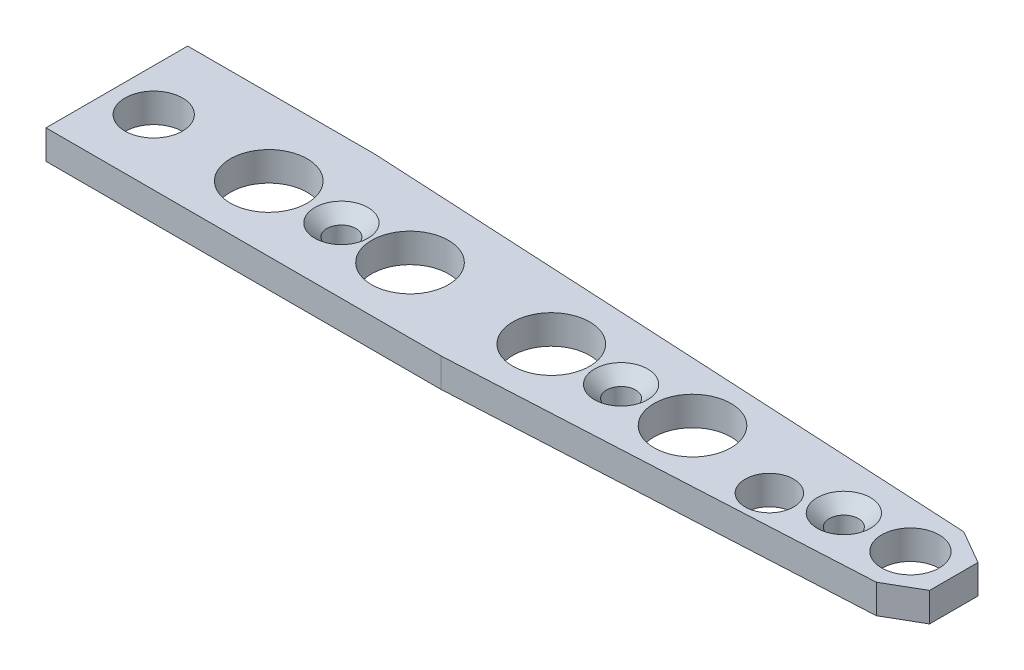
ISO-10303-21;
HEADER;
FILE_DESCRIPTION(('STEP AP214'),'2;1');
FILE_NAME('part.step','',(''),(''),'','','');
FILE_SCHEMA(('AUTOMOTIVE_DESIGN { 1 0 10303 214 1 1 1 1 }'));
ENDSEC;
DATA;
#1=APPLICATION_CONTEXT('core data for automotive mechanical design processes');
#2=APPLICATION_PROTOCOL_DEFINITION('international standard','automotive_design',2000,#1);
#3=PRODUCT_CONTEXT('',#1,'mechanical');
#4=PRODUCT('Part','Part','',(#3));
#5=PRODUCT_RELATED_PRODUCT_CATEGORY('part','',(#4));
#6=PRODUCT_DEFINITION_FORMATION('','',#4);
#7=PRODUCT_DEFINITION_CONTEXT('part definition',#1,'design');
#8=PRODUCT_DEFINITION('design','',#6,#7);
#9=PRODUCT_DEFINITION_SHAPE('','',#8);
#10=(LENGTH_UNIT() NAMED_UNIT(*) SI_UNIT(.MILLI.,.METRE.));
#11=(NAMED_UNIT(*) PLANE_ANGLE_UNIT() SI_UNIT($,.RADIAN.));
#12=(NAMED_UNIT(*) SI_UNIT($,.STERADIAN.) SOLID_ANGLE_UNIT());
#13=UNCERTAINTY_MEASURE_WITH_UNIT(LENGTH_MEASURE(1.E-05),#10,'distance_accuracy_value','');
#14=(GEOMETRIC_REPRESENTATION_CONTEXT(3) GLOBAL_UNCERTAINTY_ASSIGNED_CONTEXT((#13)) GLOBAL_UNIT_ASSIGNED_CONTEXT((#10,
#11,#12)) REPRESENTATION_CONTEXT('',''));
#15=CARTESIAN_POINT('',(0.,0.,0.));
#16=DIRECTION('',(0.,0.,1.));
#17=DIRECTION('',(1.,0.,0.));
#18=AXIS2_PLACEMENT_3D('',#15,#16,#17);
#19=CARTESIAN_POINT('',(66.7909755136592,-72.9568309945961,3.61024403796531));
#20=DIRECTION('',(0.0523359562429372,0.,0.998629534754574));
#21=DIRECTION('',(0.998629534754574,0.,-0.0523359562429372));
#22=AXIS2_PLACEMENT_3D('',#19,#20,#21);
#23=PLANE('',#22);
#24=DIRECTION('',(-0.998629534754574,0.,0.0523359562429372));
#25=VECTOR('',#24,1.);
#26=CARTESIAN_POINT('',(66.7909755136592,-2.4,3.61024403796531));
#27=LINE('',#26,#25);
#28=CARTESIAN_POINT('',(66.7909755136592,-2.4,3.61024403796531));
#29=VERTEX_POINT('',#28);
#30=CARTESIAN_POINT('',(32.6403973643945,-2.4,5.4));
#31=VERTEX_POINT('',#30);
#32=EDGE_CURVE('E41',#29,#31,#27,.T.);
#33=ORIENTED_EDGE('',*,*,#32,.F.);
#34=DIRECTION('',(0.,1.,0.));
#35=VECTOR('',#34,1.);
#36=CARTESIAN_POINT('',(66.7909755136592,-72.9568309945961,3.61024403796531));
#37=LINE('',#36,#35);
#38=CARTESIAN_POINT('',(66.7909755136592,0.,3.61024403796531));
#39=VERTEX_POINT('',#38);
#40=EDGE_CURVE('E114',#29,#39,#37,.T.);
#41=ORIENTED_EDGE('',*,*,#40,.T.);
#42=DIRECTION('',(0.998629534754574,0.,-0.0523359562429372));
#43=VECTOR('',#42,1.);
#44=CARTESIAN_POINT('',(66.7909755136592,0.,3.61024403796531));
#45=LINE('',#44,#43);
#46=CARTESIAN_POINT('',(32.6403973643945,0.,5.4));
#47=VERTEX_POINT('',#46);
#48=EDGE_CURVE('E144',#47,#39,#45,.T.);
#49=ORIENTED_EDGE('',*,*,#48,.F.);
#50=DIRECTION('',(0.,1.,0.));
#51=VECTOR('',#50,1.);
#52=CARTESIAN_POINT('',(32.6403973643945,-72.9568309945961,5.4));
#53=LINE('',#52,#51);
#54=EDGE_CURVE('E101',#31,#47,#53,.T.);
#55=ORIENTED_EDGE('',*,*,#54,.F.);
#56=EDGE_LOOP('',(#33,#41,#49,#55));
#57=FACE_BOUND('',#56,.T.);
#58=ADVANCED_FACE('F34',(#57),#23,.T.);
#59=CARTESIAN_POINT('',(32.6403973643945,-72.9568309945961,5.4));
#60=DIRECTION('',(0.,0.,1.));
#61=DIRECTION('',(1.,0.,0.));
#62=AXIS2_PLACEMENT_3D('',#59,#60,#61);
#63=PLANE('',#62);
#64=DIRECTION('',(-1.,0.,0.));
#65=VECTOR('',#64,1.);
#66=CARTESIAN_POINT('',(32.6403973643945,-2.4,5.4));
#67=LINE('',#66,#65);
#68=CARTESIAN_POINT('',(0.,-2.4,5.4));
#69=VERTEX_POINT('',#68);
#70=EDGE_CURVE('E78',#31,#69,#67,.T.);
#71=ORIENTED_EDGE('',*,*,#70,.F.);
#72=ORIENTED_EDGE('',*,*,#54,.T.);
#73=DIRECTION('',(1.,0.,0.));
#74=VECTOR('',#73,1.);
#75=CARTESIAN_POINT('',(32.6403973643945,0.,5.4));
#76=LINE('',#75,#74);
#77=CARTESIAN_POINT('',(0.,0.,5.4));
#78=VERTEX_POINT('',#77);
#79=EDGE_CURVE('E116',#78,#47,#76,.T.);
#80=ORIENTED_EDGE('',*,*,#79,.F.);
#81=DIRECTION('',(0.,1.,0.));
#82=VECTOR('',#81,1.);
#83=CARTESIAN_POINT('',(0.,-72.9568309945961,5.4));
#84=LINE('',#83,#82);
#85=EDGE_CURVE('E99',#69,#78,#84,.T.);
#86=ORIENTED_EDGE('',*,*,#85,.F.);
#87=EDGE_LOOP('',(#71,#72,#80,#86));
#88=FACE_BOUND('',#87,.T.);
#89=ADVANCED_FACE('F170',(#88),#63,.T.);
#90=CARTESIAN_POINT('',(0.,-72.9568309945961,-6.3));
#91=DIRECTION('',(-1.,0.,0.));
#92=DIRECTION('',(0.,0.,1.));
#93=AXIS2_PLACEMENT_3D('',#90,#91,#92);
#94=PLANE('',#93);
#95=DIRECTION('',(0.,0.,-1.));
#96=VECTOR('',#95,1.);
#97=CARTESIAN_POINT('',(0.,-2.4,-6.3));
#98=LINE('',#97,#96);
#99=CARTESIAN_POINT('',(0.,-2.4,-6.3));
#100=VERTEX_POINT('',#99);
#101=EDGE_CURVE('E74',#69,#100,#98,.T.);
#102=ORIENTED_EDGE('',*,*,#101,.F.);
#103=ORIENTED_EDGE('',*,*,#85,.T.);
#104=DIRECTION('',(0.,0.,1.));
#105=VECTOR('',#104,1.);
#106=CARTESIAN_POINT('',(0.,0.,-6.3));
#107=LINE('',#106,#105);
#108=CARTESIAN_POINT('',(0.,0.,-6.3));
#109=VERTEX_POINT('',#108);
#110=EDGE_CURVE('E97',#109,#78,#107,.T.);
#111=ORIENTED_EDGE('',*,*,#110,.F.);
#112=DIRECTION('',(0.,1.,0.));
#113=VECTOR('',#112,1.);
#114=CARTESIAN_POINT('',(0.,-72.9568309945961,-6.3));
#115=LINE('',#114,#113);
#116=EDGE_CURVE('E90',#100,#109,#115,.T.);
#117=ORIENTED_EDGE('',*,*,#116,.F.);
#118=EDGE_LOOP('',(#102,#103,#111,#117));
#119=FACE_BOUND('',#118,.T.);
#120=ADVANCED_FACE('F95',(#119),#94,.T.);
#121=CARTESIAN_POINT('',(0.,-72.9568309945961,-6.3));
#122=DIRECTION('',(0.,0.,-1.));
#123=DIRECTION('',(-1.,0.,0.));
#124=AXIS2_PLACEMENT_3D('',#121,#122,#123);
#125=PLANE('',#124);
#126=DIRECTION('',(1.,0.,0.));
#127=VECTOR('',#126,1.);
#128=CARTESIAN_POINT('',(0.,-2.4,-6.3));
#129=LINE('',#128,#127);
#130=CARTESIAN_POINT('',(15.467374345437,-2.4,-6.3));
#131=VERTEX_POINT('',#130);
#132=EDGE_CURVE('E77',#100,#131,#129,.T.);
#133=ORIENTED_EDGE('',*,*,#132,.F.);
#134=ORIENTED_EDGE('',*,*,#116,.T.);
#135=DIRECTION('',(-1.,0.,0.));
#136=VECTOR('',#135,1.);
#137=CARTESIAN_POINT('',(0.,0.,-6.3));
#138=LINE('',#137,#136);
#139=CARTESIAN_POINT('',(15.467374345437,0.,-6.3));
#140=VERTEX_POINT('',#139);
#141=EDGE_CURVE('E127',#140,#109,#138,.T.);
#142=ORIENTED_EDGE('',*,*,#141,.F.);
#143=DIRECTION('',(0.,1.,0.));
#144=VECTOR('',#143,1.);
#145=CARTESIAN_POINT('',(15.467374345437,-72.9568309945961,-6.3));
#146=LINE('',#145,#144);
#147=EDGE_CURVE('E93',#131,#140,#146,.T.);
#148=ORIENTED_EDGE('',*,*,#147,.F.);
#149=EDGE_LOOP('',(#133,#134,#142,#148));
#150=FACE_BOUND('',#149,.T.);
#151=ADVANCED_FACE('F87',(#150),#125,.T.);
#152=CARTESIAN_POINT('',(15.467374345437,-72.9568309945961,-6.3));
#153=DIRECTION('',(0.0523359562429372,0.,-0.998629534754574));
#154=DIRECTION('',(-0.998629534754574,0.,-0.0523359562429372));
#155=AXIS2_PLACEMENT_3D('',#152,#153,#154);
#156=PLANE('',#155);
#157=DIRECTION('',(0.998629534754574,0.,0.0523359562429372));
#158=VECTOR('',#157,1.);
#159=CARTESIAN_POINT('',(15.467374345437,-2.4,-6.3));
#160=LINE('',#159,#158);
#161=CARTESIAN_POINT('',(66.7909755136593,-2.4,-3.61024403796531));
#162=VERTEX_POINT('',#161);
#163=EDGE_CURVE('E54',#131,#162,#160,.T.);
#164=ORIENTED_EDGE('',*,*,#163,.F.);
#165=ORIENTED_EDGE('',*,*,#147,.T.);
#166=DIRECTION('',(-0.998629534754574,0.,-0.0523359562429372));
#167=VECTOR('',#166,1.);
#168=CARTESIAN_POINT('',(15.467374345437,0.,-6.3));
#169=LINE('',#168,#167);
#170=CARTESIAN_POINT('',(66.7909755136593,0.,-3.61024403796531));
#171=VERTEX_POINT('',#170);
#172=EDGE_CURVE('E156',#171,#140,#169,.T.);
#173=ORIENTED_EDGE('',*,*,#172,.F.);
#174=DIRECTION('',(0.,1.,0.));
#175=VECTOR('',#174,1.);
#176=CARTESIAN_POINT('',(66.7909755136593,-72.9568309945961,-3.61024403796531));
#177=LINE('',#176,#175);
#178=EDGE_CURVE('E103',#162,#171,#177,.T.);
#179=ORIENTED_EDGE('',*,*,#178,.F.);
#180=EDGE_LOOP('',(#164,#165,#173,#179));
#181=FACE_BOUND('',#180,.T.);
#182=ADVANCED_FACE('F182',(#181),#156,.T.);
#183=CARTESIAN_POINT('',(69.58,-72.9568309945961,-2.));
#184=DIRECTION('',(0.500000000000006,0.,-0.866025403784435));
#185=DIRECTION('',(-0.866025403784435,0.,-0.500000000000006));
#186=AXIS2_PLACEMENT_3D('',#183,#184,#185);
#187=PLANE('',#186);
#188=DIRECTION('',(0.866025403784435,0.,0.500000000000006));
#189=VECTOR('',#188,1.);
#190=CARTESIAN_POINT('',(69.58,-2.4,-2.));
#191=LINE('',#190,#189);
#192=CARTESIAN_POINT('',(69.58,-2.4,-2.));
#193=VERTEX_POINT('',#192);
#194=EDGE_CURVE('E48',#162,#193,#191,.T.);
#195=ORIENTED_EDGE('',*,*,#194,.F.);
#196=ORIENTED_EDGE('',*,*,#178,.T.);
#197=DIRECTION('',(-0.866025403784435,0.,-0.500000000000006));
#198=VECTOR('',#197,1.);
#199=CARTESIAN_POINT('',(69.58,0.,-2.));
#200=LINE('',#199,#198);
#201=CARTESIAN_POINT('',(69.58,0.,-2.));
#202=VERTEX_POINT('',#201);
#203=EDGE_CURVE('E153',#202,#171,#200,.T.);
#204=ORIENTED_EDGE('',*,*,#203,.F.);
#205=DIRECTION('',(0.,1.,0.));
#206=VECTOR('',#205,1.);
#207=CARTESIAN_POINT('',(69.58,-72.9568309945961,-2.));
#208=LINE('',#207,#206);
#209=EDGE_CURVE('E109',#193,#202,#208,.T.);
#210=ORIENTED_EDGE('',*,*,#209,.F.);
#211=EDGE_LOOP('',(#195,#196,#204,#210));
#212=FACE_BOUND('',#211,.T.);
#213=ADVANCED_FACE('F180',(#212),#187,.T.);
#214=CARTESIAN_POINT('',(69.58,-72.9568309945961,-2.));
#215=DIRECTION('',(1.,0.,0.));
#216=DIRECTION('',(0.,0.,-1.));
#217=AXIS2_PLACEMENT_3D('',#214,#215,#216);
#218=PLANE('',#217);
#219=DIRECTION('',(0.,0.,1.));
#220=VECTOR('',#219,1.);
#221=CARTESIAN_POINT('',(69.58,-2.4,-2.));
#222=LINE('',#221,#220);
#223=CARTESIAN_POINT('',(69.58,-2.4,2.));
#224=VERTEX_POINT('',#223);
#225=EDGE_CURVE('E131',#193,#224,#222,.T.);
#226=ORIENTED_EDGE('',*,*,#225,.F.);
#227=ORIENTED_EDGE('',*,*,#209,.T.);
#228=DIRECTION('',(0.,0.,-1.));
#229=VECTOR('',#228,1.);
#230=CARTESIAN_POINT('',(69.58,0.,-2.));
#231=LINE('',#230,#229);
#232=CARTESIAN_POINT('',(69.58,0.,2.));
#233=VERTEX_POINT('',#232);
#234=EDGE_CURVE('E150',#233,#202,#231,.T.);
#235=ORIENTED_EDGE('',*,*,#234,.F.);
#236=DIRECTION('',(0.,1.,0.));
#237=VECTOR('',#236,1.);
#238=CARTESIAN_POINT('',(69.58,-72.9568309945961,2.));
#239=LINE('',#238,#237);
#240=EDGE_CURVE('E112',#224,#233,#239,.T.);
#241=ORIENTED_EDGE('',*,*,#240,.F.);
#242=EDGE_LOOP('',(#226,#227,#235,#241));
#243=FACE_BOUND('',#242,.T.);
#244=ADVANCED_FACE('F178',(#243),#218,.T.);
#245=CARTESIAN_POINT('',(69.58,-72.9568309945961,2.));
#246=DIRECTION('',(0.500000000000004,0.,0.866025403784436));
#247=DIRECTION('',(0.866025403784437,0.,-0.500000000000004));
#248=AXIS2_PLACEMENT_3D('',#245,#246,#247);
#249=PLANE('',#248);
#250=DIRECTION('',(-0.866025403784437,0.,0.500000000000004));
#251=VECTOR('',#250,1.);
#252=CARTESIAN_POINT('',(69.58,-2.4,2.));
#253=LINE('',#252,#251);
#254=EDGE_CURVE('E11',#224,#29,#253,.T.);
#255=ORIENTED_EDGE('',*,*,#254,.F.);
#256=ORIENTED_EDGE('',*,*,#240,.T.);
#257=DIRECTION('',(0.866025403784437,0.,-0.500000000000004));
#258=VECTOR('',#257,1.);
#259=CARTESIAN_POINT('',(69.58,0.,2.));
#260=LINE('',#259,#258);
#261=EDGE_CURVE('E146',#39,#233,#260,.T.);
#262=ORIENTED_EDGE('',*,*,#261,.F.);
#263=ORIENTED_EDGE('',*,*,#40,.F.);
#264=EDGE_LOOP('',(#255,#256,#262,#263));
#265=FACE_BOUND('',#264,.T.);
#266=ADVANCED_FACE('F203',(#265),#249,.T.);
#267=CARTESIAN_POINT('',(0.,0.,0.));
#268=DIRECTION('',(0.,1.,0.));
#269=DIRECTION('',(0.,0.,1.));
#270=AXIS2_PLACEMENT_3D('',#267,#268,#269);
#271=PLANE('',#270);
#272=CARTESIAN_POINT('',(56.,0.,1.65));
#273=DIRECTION('',(0.,1.,0.));
#274=DIRECTION('',(0.,0.,1.));
#275=AXIS2_PLACEMENT_3D('',#272,#273,#274);
#276=CIRCLE('',#275,2.);
#277=CARTESIAN_POINT('',(56.,0.,3.65));
#278=VERTEX_POINT('',#277);
#279=EDGE_CURVE('E267',#278,#278,#276,.T.);
#280=ORIENTED_EDGE('',*,*,#279,.F.);
#281=EDGE_LOOP('',(#280));
#282=FACE_BOUND('',#281,.T.);
#283=CARTESIAN_POINT('',(13.,0.,0.));
#284=DIRECTION('',(0.,1.,0.));
#285=DIRECTION('',(0.,0.,1.));
#286=AXIS2_PLACEMENT_3D('',#283,#284,#285);
#287=CIRCLE('',#286,3.175);
#288=CARTESIAN_POINT('',(13.,0.,3.175));
#289=VERTEX_POINT('',#288);
#290=EDGE_CURVE('E276',#289,#289,#287,.T.);
#291=ORIENTED_EDGE('',*,*,#290,.F.);
#292=EDGE_LOOP('',(#291));
#293=FACE_BOUND('',#292,.T.);
#294=CARTESIAN_POINT('',(24.6666666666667,0.,0.));
#295=DIRECTION('',(0.,1.,0.));
#296=DIRECTION('',(0.,0.,1.));
#297=AXIS2_PLACEMENT_3D('',#294,#295,#296);
#298=CIRCLE('',#297,3.175);
#299=CARTESIAN_POINT('',(24.6666666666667,0.,3.175));
#300=VERTEX_POINT('',#299);
#301=EDGE_CURVE('E282',#300,#300,#298,.T.);
#302=ORIENTED_EDGE('',*,*,#301,.F.);
#303=EDGE_LOOP('',(#302));
#304=FACE_BOUND('',#303,.T.);
#305=CARTESIAN_POINT('',(36.3333333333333,0.,0.));
#306=DIRECTION('',(0.,1.,0.));
#307=DIRECTION('',(0.,0.,1.));
#308=AXIS2_PLACEMENT_3D('',#305,#306,#307);
#309=CIRCLE('',#308,3.175);
#310=CARTESIAN_POINT('',(36.3333333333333,0.,3.175));
#311=VERTEX_POINT('',#310);
#312=EDGE_CURVE('E288',#311,#311,#309,.T.);
#313=ORIENTED_EDGE('',*,*,#312,.F.);
#314=EDGE_LOOP('',(#313));
#315=FACE_BOUND('',#314,.T.);
#316=CARTESIAN_POINT('',(48.,0.,0.));
#317=DIRECTION('',(0.,1.,0.));
#318=DIRECTION('',(0.,0.,1.));
#319=AXIS2_PLACEMENT_3D('',#316,#317,#318);
#320=CIRCLE('',#319,3.175);
#321=CARTESIAN_POINT('',(48.,0.,3.175));
#322=VERTEX_POINT('',#321);
#323=EDGE_CURVE('E269',#322,#322,#320,.T.);
#324=ORIENTED_EDGE('',*,*,#323,.F.);
#325=EDGE_LOOP('',(#324));
#326=FACE_BOUND('',#325,.T.);
#327=CARTESIAN_POINT('',(19.,0.,0.));
#328=DIRECTION('',(0.,1.,0.));
#329=DIRECTION('',(0.,0.,1.));
#330=AXIS2_PLACEMENT_3D('',#327,#328,#329);
#331=CIRCLE('',#330,2.2);
#332=CARTESIAN_POINT('',(19.,0.,2.2));
#333=VERTEX_POINT('',#332);
#334=EDGE_CURVE('E275',#333,#333,#331,.T.);
#335=ORIENTED_EDGE('',*,*,#334,.F.);
#336=EDGE_LOOP('',(#335));
#337=FACE_BOUND('',#336,.T.);
#338=CARTESIAN_POINT('',(42.1,0.,0.));
#339=DIRECTION('',(0.,1.,0.));
#340=DIRECTION('',(0.,0.,1.));
#341=AXIS2_PLACEMENT_3D('',#338,#339,#340);
#342=CIRCLE('',#341,2.2);
#343=CARTESIAN_POINT('',(42.1,0.,2.2));
#344=VERTEX_POINT('',#343);
#345=EDGE_CURVE('E304',#344,#344,#342,.T.);
#346=ORIENTED_EDGE('',*,*,#345,.F.);
#347=EDGE_LOOP('',(#346));
#348=FACE_BOUND('',#347,.T.);
#349=CARTESIAN_POINT('',(60.5,0.,0.));
#350=DIRECTION('',(0.,1.,0.));
#351=DIRECTION('',(0.,0.,1.));
#352=AXIS2_PLACEMENT_3D('',#349,#350,#351);
#353=CIRCLE('',#352,2.2);
#354=CARTESIAN_POINT('',(60.5,0.,2.2));
#355=VERTEX_POINT('',#354);
#356=EDGE_CURVE('E313',#355,#355,#353,.T.);
#357=ORIENTED_EDGE('',*,*,#356,.F.);
#358=EDGE_LOOP('',(#357));
#359=FACE_BOUND('',#358,.T.);
#360=CARTESIAN_POINT('',(3.5,0.,0.));
#361=DIRECTION('',(0.,1.,0.));
#362=DIRECTION('',(0.,0.,1.));
#363=AXIS2_PLACEMENT_3D('',#360,#361,#362);
#364=CIRCLE('',#363,2.375);
#365=CARTESIAN_POINT('',(3.5,0.,2.375));
#366=VERTEX_POINT('',#365);
#367=EDGE_CURVE('E324',#366,#366,#364,.T.);
#368=ORIENTED_EDGE('',*,*,#367,.F.);
#369=EDGE_LOOP('',(#368));
#370=FACE_BOUND('',#369,.T.);
#371=CARTESIAN_POINT('',(66.,0.,0.));
#372=DIRECTION('',(0.,1.,0.));
#373=DIRECTION('',(0.,0.,1.));
#374=AXIS2_PLACEMENT_3D('',#371,#372,#373);
#375=CIRCLE('',#374,2.375);
#376=CARTESIAN_POINT('',(66.,0.,2.375));
#377=VERTEX_POINT('',#376);
#378=EDGE_CURVE('E138',#377,#377,#375,.T.);
#379=ORIENTED_EDGE('',*,*,#378,.F.);
#380=EDGE_LOOP('',(#379));
#381=FACE_BOUND('',#380,.T.);
#382=ORIENTED_EDGE('',*,*,#48,.T.);
#383=ORIENTED_EDGE('',*,*,#261,.T.);
#384=ORIENTED_EDGE('',*,*,#234,.T.);
#385=ORIENTED_EDGE('',*,*,#203,.T.);
#386=ORIENTED_EDGE('',*,*,#172,.T.);
#387=ORIENTED_EDGE('',*,*,#141,.T.);
#388=ORIENTED_EDGE('',*,*,#110,.T.);
#389=ORIENTED_EDGE('',*,*,#79,.T.);
#390=EDGE_LOOP('',(#382,#383,#384,#385,#386,#387,#388,#389));
#391=FACE_BOUND('',#390,.T.);
#392=ADVANCED_FACE('F158',(#282,#293,#304,#315,#326,#337,#348,#359,#370,#381,#391),#271,.T.);
#393=CARTESIAN_POINT('',(0.,-2.4,0.));
#394=DIRECTION('',(0.,1.,0.));
#395=DIRECTION('',(0.,0.,1.));
#396=AXIS2_PLACEMENT_3D('',#393,#394,#395);
#397=PLANE('',#396);
#398=CARTESIAN_POINT('',(56.,-2.4,1.65));
#399=DIRECTION('',(0.,1.,0.));
#400=DIRECTION('',(0.,0.,1.));
#401=AXIS2_PLACEMENT_3D('',#398,#399,#400);
#402=CIRCLE('',#401,2.);
#403=CARTESIAN_POINT('',(56.,-2.4,3.65));
#404=VERTEX_POINT('',#403);
#405=EDGE_CURVE('E264',#404,#404,#402,.T.);
#406=ORIENTED_EDGE('',*,*,#405,.T.);
#407=EDGE_LOOP('',(#406));
#408=FACE_BOUND('',#407,.T.);
#409=CARTESIAN_POINT('',(13.,-2.4,0.));
#410=DIRECTION('',(0.,1.,0.));
#411=DIRECTION('',(0.,0.,1.));
#412=AXIS2_PLACEMENT_3D('',#409,#410,#411);
#413=CIRCLE('',#412,3.175);
#414=CARTESIAN_POINT('',(13.,-2.4,3.175));
#415=VERTEX_POINT('',#414);
#416=EDGE_CURVE('E272',#415,#415,#413,.T.);
#417=ORIENTED_EDGE('',*,*,#416,.T.);
#418=EDGE_LOOP('',(#417));
#419=FACE_BOUND('',#418,.T.);
#420=CARTESIAN_POINT('',(24.6666666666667,-2.4,0.));
#421=DIRECTION('',(0.,1.,0.));
#422=DIRECTION('',(0.,0.,1.));
#423=AXIS2_PLACEMENT_3D('',#420,#421,#422);
#424=CIRCLE('',#423,3.175);
#425=CARTESIAN_POINT('',(24.6666666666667,-2.4,3.175));
#426=VERTEX_POINT('',#425);
#427=EDGE_CURVE('E279',#426,#426,#424,.T.);
#428=ORIENTED_EDGE('',*,*,#427,.T.);
#429=EDGE_LOOP('',(#428));
#430=FACE_BOUND('',#429,.T.);
#431=CARTESIAN_POINT('',(36.3333333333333,-2.4,0.));
#432=DIRECTION('',(0.,1.,0.));
#433=DIRECTION('',(0.,0.,1.));
#434=AXIS2_PLACEMENT_3D('',#431,#432,#433);
#435=CIRCLE('',#434,3.175);
#436=CARTESIAN_POINT('',(36.3333333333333,-2.4,3.175));
#437=VERTEX_POINT('',#436);
#438=EDGE_CURVE('E285',#437,#437,#435,.T.);
#439=ORIENTED_EDGE('',*,*,#438,.T.);
#440=EDGE_LOOP('',(#439));
#441=FACE_BOUND('',#440,.T.);
#442=CARTESIAN_POINT('',(48.,-2.4,0.));
#443=DIRECTION('',(0.,1.,0.));
#444=DIRECTION('',(0.,0.,1.));
#445=AXIS2_PLACEMENT_3D('',#442,#443,#444);
#446=CIRCLE('',#445,3.175);
#447=CARTESIAN_POINT('',(48.,-2.4,3.175));
#448=VERTEX_POINT('',#447);
#449=EDGE_CURVE('E291',#448,#448,#446,.T.);
#450=ORIENTED_EDGE('',*,*,#449,.T.);
#451=EDGE_LOOP('',(#450));
#452=FACE_BOUND('',#451,.T.);
#453=CARTESIAN_POINT('',(19.,-2.4,0.));
#454=DIRECTION('',(0.,1.,0.));
#455=DIRECTION('',(0.,0.,1.));
#456=AXIS2_PLACEMENT_3D('',#453,#454,#455);
#457=CIRCLE('',#456,1.2);
#458=CARTESIAN_POINT('',(19.,-2.4,1.2));
#459=VERTEX_POINT('',#458);
#460=EDGE_CURVE('E301',#459,#459,#457,.T.);
#461=ORIENTED_EDGE('',*,*,#460,.T.);
#462=EDGE_LOOP('',(#461));
#463=FACE_BOUND('',#462,.T.);
#464=CARTESIAN_POINT('',(42.1,-2.4,0.));
#465=DIRECTION('',(0.,1.,0.));
#466=DIRECTION('',(0.,0.,1.));
#467=AXIS2_PLACEMENT_3D('',#464,#465,#466);
#468=CIRCLE('',#467,1.2);
#469=CARTESIAN_POINT('',(42.1,-2.4,1.2));
#470=VERTEX_POINT('',#469);
#471=EDGE_CURVE('E310',#470,#470,#468,.T.);
#472=ORIENTED_EDGE('',*,*,#471,.T.);
#473=EDGE_LOOP('',(#472));
#474=FACE_BOUND('',#473,.T.);
#475=CARTESIAN_POINT('',(60.5,-2.4,0.));
#476=DIRECTION('',(0.,1.,0.));
#477=DIRECTION('',(0.,0.,1.));
#478=AXIS2_PLACEMENT_3D('',#475,#476,#477);
#479=CIRCLE('',#478,1.2);
#480=CARTESIAN_POINT('',(60.5,-2.4,1.2));
#481=VERTEX_POINT('',#480);
#482=EDGE_CURVE('E319',#481,#481,#479,.T.);
#483=ORIENTED_EDGE('',*,*,#482,.T.);
#484=EDGE_LOOP('',(#483));
#485=FACE_BOUND('',#484,.T.);
#486=CARTESIAN_POINT('',(3.5,-2.4,0.));
#487=DIRECTION('',(0.,1.,0.));
#488=DIRECTION('',(0.,0.,1.));
#489=AXIS2_PLACEMENT_3D('',#486,#487,#488);
#490=CIRCLE('',#489,2.375);
#491=CARTESIAN_POINT('',(3.5,-2.4,2.375));
#492=VERTEX_POINT('',#491);
#493=EDGE_CURVE('E147',#492,#492,#490,.T.);
#494=ORIENTED_EDGE('',*,*,#493,.T.);
#495=EDGE_LOOP('',(#494));
#496=FACE_BOUND('',#495,.T.);
#497=CARTESIAN_POINT('',(66.,-2.4,0.));
#498=DIRECTION('',(0.,1.,0.));
#499=DIRECTION('',(0.,0.,1.));
#500=AXIS2_PLACEMENT_3D('',#497,#498,#499);
#501=CIRCLE('',#500,2.375);
#502=CARTESIAN_POINT('',(66.,-2.4,2.375));
#503=VERTEX_POINT('',#502);
#504=EDGE_CURVE('E326',#503,#503,#501,.T.);
#505=ORIENTED_EDGE('',*,*,#504,.T.);
#506=EDGE_LOOP('',(#505));
#507=FACE_BOUND('',#506,.T.);
#508=ORIENTED_EDGE('',*,*,#32,.T.);
#509=ORIENTED_EDGE('',*,*,#70,.T.);
#510=ORIENTED_EDGE('',*,*,#101,.T.);
#511=ORIENTED_EDGE('',*,*,#132,.T.);
#512=ORIENTED_EDGE('',*,*,#163,.T.);
#513=ORIENTED_EDGE('',*,*,#194,.T.);
#514=ORIENTED_EDGE('',*,*,#225,.T.);
#515=ORIENTED_EDGE('',*,*,#254,.T.);
#516=EDGE_LOOP('',(#508,#509,#510,#511,#512,#513,#514,#515));
#517=FACE_BOUND('',#516,.T.);
#518=ADVANCED_FACE('F76',(#408,#419,#430,#441,#452,#463,#474,#485,#496,#507,#517),#397,.F.);
#519=CARTESIAN_POINT('',(66.,-2.4,0.));
#520=DIRECTION('',(0.,1.,0.));
#521=DIRECTION('',(0.,0.,1.));
#522=AXIS2_PLACEMENT_3D('',#519,#520,#521);
#523=CYLINDRICAL_SURFACE('',#522,2.375);
#524=ORIENTED_EDGE('',*,*,#504,.F.);
#525=EDGE_LOOP('',(#524));
#526=FACE_BOUND('',#525,.T.);
#527=ORIENTED_EDGE('',*,*,#378,.T.);
#528=EDGE_LOOP('',(#527));
#529=FACE_BOUND('',#528,.T.);
#530=ADVANCED_FACE('F207',(#526,#529),#523,.F.);
#531=CARTESIAN_POINT('',(3.5,-2.4,0.));
#532=DIRECTION('',(0.,1.,0.));
#533=DIRECTION('',(0.,0.,1.));
#534=AXIS2_PLACEMENT_3D('',#531,#532,#533);
#535=CYLINDRICAL_SURFACE('',#534,2.375);
#536=ORIENTED_EDGE('',*,*,#493,.F.);
#537=EDGE_LOOP('',(#536));
#538=FACE_BOUND('',#537,.T.);
#539=ORIENTED_EDGE('',*,*,#367,.T.);
#540=EDGE_LOOP('',(#539));
#541=FACE_BOUND('',#540,.T.);
#542=ADVANCED_FACE('F211',(#538,#541),#535,.F.);
#543=CARTESIAN_POINT('',(60.5,0.,0.));
#544=DIRECTION('',(0.,1.,0.));
#545=DIRECTION('',(0.,0.,1.));
#546=AXIS2_PLACEMENT_3D('',#543,#544,#545);
#547=CYLINDRICAL_SURFACE('',#546,1.2);
#548=ORIENTED_EDGE('',*,*,#482,.F.);
#549=EDGE_LOOP('',(#548));
#550=FACE_BOUND('',#549,.T.);
#551=CARTESIAN_POINT('',(60.5,-1.,0.));
#552=DIRECTION('',(0.,1.,0.));
#553=DIRECTION('',(0.,0.,1.));
#554=AXIS2_PLACEMENT_3D('',#551,#552,#553);
#555=CIRCLE('',#554,1.2);
#556=CARTESIAN_POINT('',(60.5,-1.,1.2));
#557=VERTEX_POINT('',#556);
#558=EDGE_CURVE('E316',#557,#557,#555,.T.);
#559=ORIENTED_EDGE('',*,*,#558,.T.);
#560=EDGE_LOOP('',(#559));
#561=FACE_BOUND('',#560,.T.);
#562=ADVANCED_FACE('F215',(#550,#561),#547,.F.);
#563=CARTESIAN_POINT('',(60.5,0.,0.));
#564=DIRECTION('',(0.,1.,0.));
#565=DIRECTION('',(0.,0.,1.));
#566=AXIS2_PLACEMENT_3D('',#563,#564,#565);
#567=CONICAL_SURFACE('',#566,2.2,0.785398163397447);
#568=ORIENTED_EDGE('',*,*,#558,.F.);
#569=EDGE_LOOP('',(#568));
#570=FACE_BOUND('',#569,.T.);
#571=ORIENTED_EDGE('',*,*,#356,.T.);
#572=EDGE_LOOP('',(#571));
#573=FACE_BOUND('',#572,.T.);
#574=ADVANCED_FACE('F219',(#570,#573),#567,.F.);
#575=CARTESIAN_POINT('',(42.1,0.,0.));
#576=DIRECTION('',(0.,1.,0.));
#577=DIRECTION('',(0.,0.,1.));
#578=AXIS2_PLACEMENT_3D('',#575,#576,#577);
#579=CYLINDRICAL_SURFACE('',#578,1.2);
#580=ORIENTED_EDGE('',*,*,#471,.F.);
#581=EDGE_LOOP('',(#580));
#582=FACE_BOUND('',#581,.T.);
#583=CARTESIAN_POINT('',(42.1,-1.,0.));
#584=DIRECTION('',(0.,1.,0.));
#585=DIRECTION('',(0.,0.,1.));
#586=AXIS2_PLACEMENT_3D('',#583,#584,#585);
#587=CIRCLE('',#586,1.2);
#588=CARTESIAN_POINT('',(42.1,-1.,1.2));
#589=VERTEX_POINT('',#588);
#590=EDGE_CURVE('E307',#589,#589,#587,.T.);
#591=ORIENTED_EDGE('',*,*,#590,.T.);
#592=EDGE_LOOP('',(#591));
#593=FACE_BOUND('',#592,.T.);
#594=ADVANCED_FACE('F223',(#582,#593),#579,.F.);
#595=CARTESIAN_POINT('',(42.1,0.,0.));
#596=DIRECTION('',(0.,1.,0.));
#597=DIRECTION('',(0.,0.,1.));
#598=AXIS2_PLACEMENT_3D('',#595,#596,#597);
#599=CONICAL_SURFACE('',#598,2.2,0.785398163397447);
#600=ORIENTED_EDGE('',*,*,#590,.F.);
#601=EDGE_LOOP('',(#600));
#602=FACE_BOUND('',#601,.T.);
#603=ORIENTED_EDGE('',*,*,#345,.T.);
#604=EDGE_LOOP('',(#603));
#605=FACE_BOUND('',#604,.T.);
#606=ADVANCED_FACE('F227',(#602,#605),#599,.F.);
#607=CARTESIAN_POINT('',(19.,0.,0.));
#608=DIRECTION('',(0.,1.,0.));
#609=DIRECTION('',(0.,0.,1.));
#610=AXIS2_PLACEMENT_3D('',#607,#608,#609);
#611=CYLINDRICAL_SURFACE('',#610,1.2);
#612=ORIENTED_EDGE('',*,*,#460,.F.);
#613=EDGE_LOOP('',(#612));
#614=FACE_BOUND('',#613,.T.);
#615=CARTESIAN_POINT('',(19.,-1.,0.));
#616=DIRECTION('',(0.,1.,0.));
#617=DIRECTION('',(0.,0.,1.));
#618=AXIS2_PLACEMENT_3D('',#615,#616,#617);
#619=CIRCLE('',#618,1.2);
#620=CARTESIAN_POINT('',(19.,-1.,1.2));
#621=VERTEX_POINT('',#620);
#622=EDGE_CURVE('E298',#621,#621,#619,.T.);
#623=ORIENTED_EDGE('',*,*,#622,.T.);
#624=EDGE_LOOP('',(#623));
#625=FACE_BOUND('',#624,.T.);
#626=ADVANCED_FACE('F231',(#614,#625),#611,.F.);
#627=CARTESIAN_POINT('',(19.,0.,0.));
#628=DIRECTION('',(0.,1.,0.));
#629=DIRECTION('',(0.,0.,1.));
#630=AXIS2_PLACEMENT_3D('',#627,#628,#629);
#631=CONICAL_SURFACE('',#630,2.2,0.785398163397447);
#632=ORIENTED_EDGE('',*,*,#622,.F.);
#633=EDGE_LOOP('',(#632));
#634=FACE_BOUND('',#633,.T.);
#635=ORIENTED_EDGE('',*,*,#334,.T.);
#636=EDGE_LOOP('',(#635));
#637=FACE_BOUND('',#636,.T.);
#638=ADVANCED_FACE('F235',(#634,#637),#631,.F.);
#639=CARTESIAN_POINT('',(48.,-2.4,0.));
#640=DIRECTION('',(0.,1.,0.));
#641=DIRECTION('',(0.,0.,1.));
#642=AXIS2_PLACEMENT_3D('',#639,#640,#641);
#643=CYLINDRICAL_SURFACE('',#642,3.175);
#644=ORIENTED_EDGE('',*,*,#449,.F.);
#645=EDGE_LOOP('',(#644));
#646=FACE_BOUND('',#645,.T.);
#647=ORIENTED_EDGE('',*,*,#323,.T.);
#648=EDGE_LOOP('',(#647));
#649=FACE_BOUND('',#648,.T.);
#650=ADVANCED_FACE('F239',(#646,#649),#643,.F.);
#651=CARTESIAN_POINT('',(36.3333333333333,-2.4,0.));
#652=DIRECTION('',(0.,1.,0.));
#653=DIRECTION('',(0.,0.,1.));
#654=AXIS2_PLACEMENT_3D('',#651,#652,#653);
#655=CYLINDRICAL_SURFACE('',#654,3.175);
#656=ORIENTED_EDGE('',*,*,#438,.F.);
#657=EDGE_LOOP('',(#656));
#658=FACE_BOUND('',#657,.T.);
#659=ORIENTED_EDGE('',*,*,#312,.T.);
#660=EDGE_LOOP('',(#659));
#661=FACE_BOUND('',#660,.T.);
#662=ADVANCED_FACE('F243',(#658,#661),#655,.F.);
#663=CARTESIAN_POINT('',(24.6666666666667,-2.4,0.));
#664=DIRECTION('',(0.,1.,0.));
#665=DIRECTION('',(0.,0.,1.));
#666=AXIS2_PLACEMENT_3D('',#663,#664,#665);
#667=CYLINDRICAL_SURFACE('',#666,3.175);
#668=ORIENTED_EDGE('',*,*,#427,.F.);
#669=EDGE_LOOP('',(#668));
#670=FACE_BOUND('',#669,.T.);
#671=ORIENTED_EDGE('',*,*,#301,.T.);
#672=EDGE_LOOP('',(#671));
#673=FACE_BOUND('',#672,.T.);
#674=ADVANCED_FACE('F247',(#670,#673),#667,.F.);
#675=CARTESIAN_POINT('',(13.,-2.4,0.));
#676=DIRECTION('',(0.,1.,0.));
#677=DIRECTION('',(0.,0.,1.));
#678=AXIS2_PLACEMENT_3D('',#675,#676,#677);
#679=CYLINDRICAL_SURFACE('',#678,3.175);
#680=ORIENTED_EDGE('',*,*,#416,.F.);
#681=EDGE_LOOP('',(#680));
#682=FACE_BOUND('',#681,.T.);
#683=ORIENTED_EDGE('',*,*,#290,.T.);
#684=EDGE_LOOP('',(#683));
#685=FACE_BOUND('',#684,.T.);
#686=ADVANCED_FACE('F251',(#682,#685),#679,.F.);
#687=CARTESIAN_POINT('',(56.,-2.4,1.65));
#688=DIRECTION('',(0.,1.,0.));
#689=DIRECTION('',(0.,0.,1.));
#690=AXIS2_PLACEMENT_3D('',#687,#688,#689);
#691=CYLINDRICAL_SURFACE('',#690,2.);
#692=ORIENTED_EDGE('',*,*,#405,.F.);
#693=EDGE_LOOP('',(#692));
#694=FACE_BOUND('',#693,.T.);
#695=ORIENTED_EDGE('',*,*,#279,.T.);
#696=EDGE_LOOP('',(#695));
#697=FACE_BOUND('',#696,.T.);
#698=ADVANCED_FACE('F255',(#694,#697),#691,.F.);
#699=CLOSED_SHELL('',(#58,#89,#120,#151,#182,#213,#244,#266,#392,#518,#530,#542,#562,#574,#594,
#606,#626,#638,#650,#662,#674,#686,#698));
#700=MANIFOLD_SOLID_BREP('B2',#699);
#701=ADVANCED_BREP_SHAPE_REPRESENTATION('',(#18,#700),#14);
#702=SHAPE_DEFINITION_REPRESENTATION(#9,#701);
ENDSEC;
END-ISO-10303-21;
